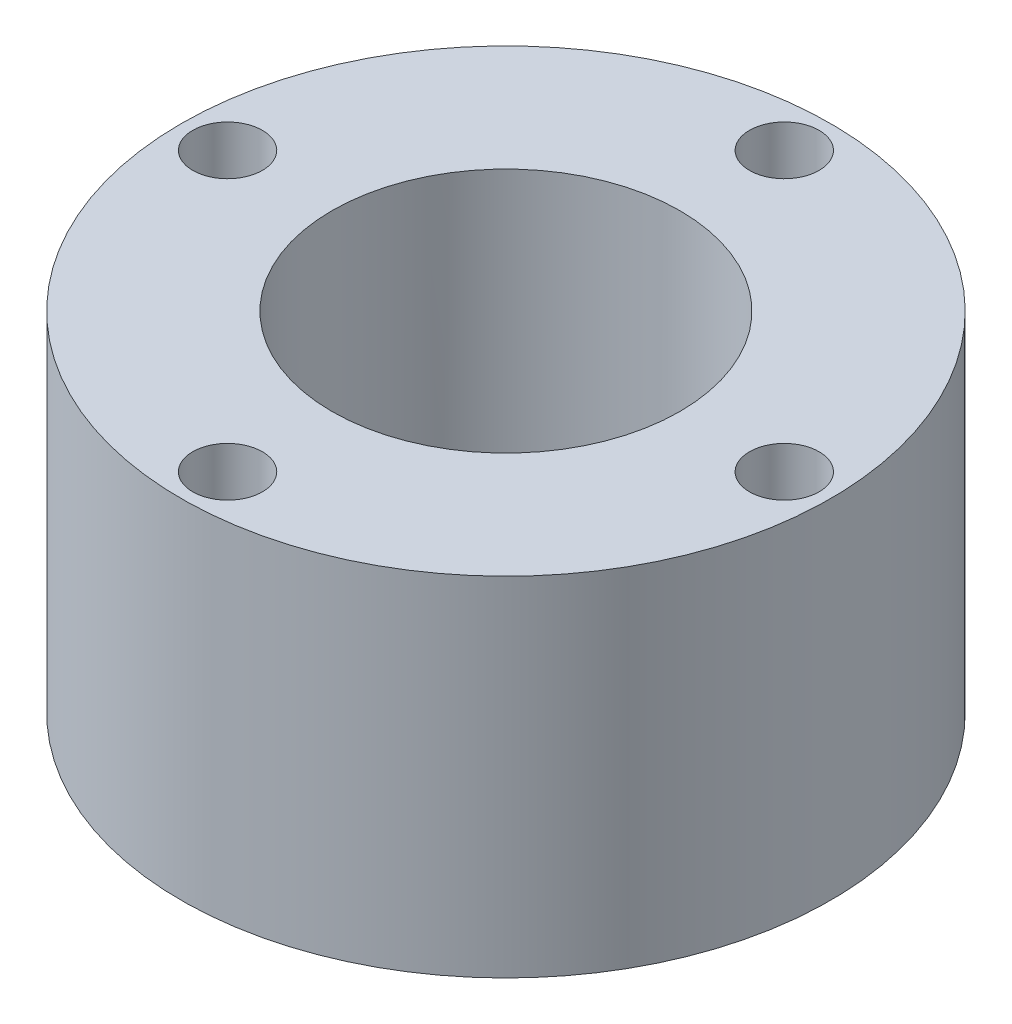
ISO-10303-21;
HEADER;
FILE_DESCRIPTION(('STEP AP214'),'2;1');
FILE_NAME('part.step','',(''),(''),'','','');
FILE_SCHEMA(('AUTOMOTIVE_DESIGN { 1 0 10303 214 1 1 1 1 }'));
ENDSEC;
DATA;
#1=APPLICATION_CONTEXT('core data for automotive mechanical design processes');
#2=APPLICATION_PROTOCOL_DEFINITION('international standard','automotive_design',2000,#1);
#3=PRODUCT_CONTEXT('',#1,'mechanical');
#4=PRODUCT('Part','Part','',(#3));
#5=PRODUCT_RELATED_PRODUCT_CATEGORY('part','',(#4));
#6=PRODUCT_DEFINITION_FORMATION('','',#4);
#7=PRODUCT_DEFINITION_CONTEXT('part definition',#1,'design');
#8=PRODUCT_DEFINITION('design','',#6,#7);
#9=PRODUCT_DEFINITION_SHAPE('','',#8);
#10=(LENGTH_UNIT() NAMED_UNIT(*) SI_UNIT(.MILLI.,.METRE.));
#11=(NAMED_UNIT(*) PLANE_ANGLE_UNIT() SI_UNIT($,.RADIAN.));
#12=(NAMED_UNIT(*) SI_UNIT($,.STERADIAN.) SOLID_ANGLE_UNIT());
#13=UNCERTAINTY_MEASURE_WITH_UNIT(LENGTH_MEASURE(1.E-05),#10,'distance_accuracy_value','');
#14=(GEOMETRIC_REPRESENTATION_CONTEXT(3) GLOBAL_UNCERTAINTY_ASSIGNED_CONTEXT((#13)) GLOBAL_UNIT_ASSIGNED_CONTEXT((#10,
#11,#12)) REPRESENTATION_CONTEXT('',''));
#15=CARTESIAN_POINT('',(0.,0.,0.));
#16=DIRECTION('',(0.,0.,1.));
#17=DIRECTION('',(1.,0.,0.));
#18=AXIS2_PLACEMENT_3D('',#15,#16,#17);
#19=CARTESIAN_POINT('',(0.,120.,0.));
#20=DIRECTION('',(0.,1.,0.));
#21=DIRECTION('',(-1.,0.,0.));
#22=AXIS2_PLACEMENT_3D('',#19,#20,#21);
#23=CYLINDRICAL_SURFACE('',#22,14.);
#24=CARTESIAN_POINT('',(0.,0.,0.));
#25=DIRECTION('',(0.,1.,0.));
#26=DIRECTION('',(-1.,0.,0.));
#27=AXIS2_PLACEMENT_3D('',#24,#25,#26);
#28=CIRCLE('',#27,14.);
#29=CARTESIAN_POINT('',(-14.,0.,0.));
#30=VERTEX_POINT('',#29);
#31=EDGE_CURVE('E10',#30,#30,#28,.T.);
#32=ORIENTED_EDGE('',*,*,#31,.T.);
#33=EDGE_LOOP('',(#32));
#34=FACE_BOUND('',#33,.T.);
#35=CARTESIAN_POINT('',(0.,15.,0.));
#36=DIRECTION('',(0.,1.,0.));
#37=DIRECTION('',(-1.,0.,0.));
#38=AXIS2_PLACEMENT_3D('',#35,#36,#37);
#39=CIRCLE('',#38,14.);
#40=CARTESIAN_POINT('',(-14.,15.,0.));
#41=VERTEX_POINT('',#40);
#42=EDGE_CURVE('E46',#41,#41,#39,.T.);
#43=ORIENTED_EDGE('',*,*,#42,.F.);
#44=EDGE_LOOP('',(#43));
#45=FACE_BOUND('',#44,.T.);
#46=ADVANCED_FACE('F32',(#34,#45),#23,.T.);
#47=CARTESIAN_POINT('',(0.,15.8,0.));
#48=DIRECTION('',(0.,-1.,0.));
#49=DIRECTION('',(1.,0.,0.));
#50=AXIS2_PLACEMENT_3D('',#47,#48,#49);
#51=CYLINDRICAL_SURFACE('',#50,7.5);
#52=CARTESIAN_POINT('',(0.,0.,0.));
#53=DIRECTION('',(0.,-1.,0.));
#54=DIRECTION('',(1.,0.,0.));
#55=AXIS2_PLACEMENT_3D('',#52,#53,#54);
#56=CIRCLE('',#55,7.5);
#57=CARTESIAN_POINT('',(7.5,0.,0.));
#58=VERTEX_POINT('',#57);
#59=EDGE_CURVE('E40',#58,#58,#56,.T.);
#60=ORIENTED_EDGE('',*,*,#59,.T.);
#61=EDGE_LOOP('',(#60));
#62=FACE_BOUND('',#61,.T.);
#63=CARTESIAN_POINT('',(0.,15.,0.));
#64=DIRECTION('',(0.,1.,0.));
#65=DIRECTION('',(-1.,0.,0.));
#66=AXIS2_PLACEMENT_3D('',#63,#64,#65);
#67=CIRCLE('',#66,7.5);
#68=CARTESIAN_POINT('',(-7.5,15.,0.));
#69=VERTEX_POINT('',#68);
#70=EDGE_CURVE('E36',#69,#69,#67,.F.);
#71=ORIENTED_EDGE('',*,*,#70,.F.);
#72=EDGE_LOOP('',(#71));
#73=FACE_BOUND('',#72,.T.);
#74=ADVANCED_FACE('F99',(#62,#73),#51,.F.);
#75=CARTESIAN_POINT('',(0.,0.,0.));
#76=DIRECTION('',(0.,1.,0.));
#77=DIRECTION('',(-1.,0.,0.));
#78=AXIS2_PLACEMENT_3D('',#75,#76,#77);
#79=PLANE('',#78);
#80=ORIENTED_EDGE('',*,*,#59,.F.);
#81=EDGE_LOOP('',(#80));
#82=FACE_BOUND('',#81,.T.);
#83=ORIENTED_EDGE('',*,*,#31,.F.);
#84=EDGE_LOOP('',(#83));
#85=FACE_BOUND('',#84,.T.);
#86=ADVANCED_FACE('F34',(#82,#85),#79,.F.);
#87=CARTESIAN_POINT('',(0.,15.,0.));
#88=DIRECTION('',(0.,1.,0.));
#89=DIRECTION('',(-1.,0.,0.));
#90=AXIS2_PLACEMENT_3D('',#87,#88,#89);
#91=PLANE('',#90);
#92=CARTESIAN_POINT('',(-11.9999999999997,15.,3.41060513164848E-13));
#93=DIRECTION('',(0.,1.,0.));
#94=DIRECTION('',(-1.,0.,0.));
#95=AXIS2_PLACEMENT_3D('',#92,#93,#94);
#96=CIRCLE('',#95,1.50000000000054);
#97=CARTESIAN_POINT('',(-13.5000000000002,15.,3.41060513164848E-13));
#98=VERTEX_POINT('',#97);
#99=EDGE_CURVE('E68',#98,#98,#96,.T.);
#100=ORIENTED_EDGE('',*,*,#99,.F.);
#101=EDGE_LOOP('',(#100));
#102=FACE_BOUND('',#101,.T.);
#103=CARTESIAN_POINT('',(6.78965033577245E-13,15.,12.));
#104=DIRECTION('',(0.,1.,0.));
#105=DIRECTION('',(-1.,0.,0.));
#106=AXIS2_PLACEMENT_3D('',#103,#104,#105);
#107=CIRCLE('',#106,1.50000000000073);
#108=CARTESIAN_POINT('',(-1.50000000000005,15.,12.));
#109=VERTEX_POINT('',#108);
#110=EDGE_CURVE('E62',#109,#109,#107,.T.);
#111=ORIENTED_EDGE('',*,*,#110,.F.);
#112=EDGE_LOOP('',(#111));
#113=FACE_BOUND('',#112,.T.);
#114=CARTESIAN_POINT('',(12.0000000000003,15.,-3.39590937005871E-13));
#115=DIRECTION('',(0.,1.,0.));
#116=DIRECTION('',(-1.,0.,0.));
#117=AXIS2_PLACEMENT_3D('',#114,#115,#116);
#118=CIRCLE('',#117,1.50000000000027);
#119=CARTESIAN_POINT('',(10.5000000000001,15.,-3.39590937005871E-13));
#120=VERTEX_POINT('',#119);
#121=EDGE_CURVE('E56',#120,#120,#118,.T.);
#122=ORIENTED_EDGE('',*,*,#121,.F.);
#123=EDGE_LOOP('',(#122));
#124=FACE_BOUND('',#123,.T.);
#125=CARTESIAN_POINT('',(0.,15.,-12.));
#126=DIRECTION('',(0.,1.,0.));
#127=DIRECTION('',(-1.,0.,0.));
#128=AXIS2_PLACEMENT_3D('',#125,#126,#127);
#129=CIRCLE('',#128,1.5);
#130=CARTESIAN_POINT('',(-1.5,15.,-12.));
#131=VERTEX_POINT('',#130);
#132=EDGE_CURVE('E50',#131,#131,#129,.T.);
#133=ORIENTED_EDGE('',*,*,#132,.F.);
#134=EDGE_LOOP('',(#133));
#135=FACE_BOUND('',#134,.T.);
#136=ORIENTED_EDGE('',*,*,#42,.T.);
#137=EDGE_LOOP('',(#136));
#138=FACE_BOUND('',#137,.T.);
#139=ORIENTED_EDGE('',*,*,#70,.T.);
#140=EDGE_LOOP('',(#139));
#141=FACE_BOUND('',#140,.T.);
#142=ADVANCED_FACE('F83',(#102,#113,#124,#135,#138,#141),#91,.T.);
#143=CARTESIAN_POINT('',(0.,11.5,-12.));
#144=DIRECTION('',(0.,1.,0.));
#145=DIRECTION('',(-1.,0.,0.));
#146=AXIS2_PLACEMENT_3D('',#143,#144,#145);
#147=CYLINDRICAL_SURFACE('',#146,1.5);
#148=CARTESIAN_POINT('',(0.,11.5,-12.));
#149=DIRECTION('',(0.,1.,0.));
#150=DIRECTION('',(-1.,0.,0.));
#151=AXIS2_PLACEMENT_3D('',#148,#149,#150);
#152=CIRCLE('',#151,1.5);
#153=CARTESIAN_POINT('',(-1.5,11.5,-12.));
#154=VERTEX_POINT('',#153);
#155=EDGE_CURVE('E49',#154,#154,#152,.T.);
#156=ORIENTED_EDGE('',*,*,#155,.F.);
#157=EDGE_LOOP('',(#156));
#158=FACE_BOUND('',#157,.T.);
#159=ORIENTED_EDGE('',*,*,#132,.T.);
#160=EDGE_LOOP('',(#159));
#161=FACE_BOUND('',#160,.T.);
#162=ADVANCED_FACE('F86',(#158,#161),#147,.F.);
#163=CARTESIAN_POINT('',(0.,11.5,-12.));
#164=DIRECTION('',(0.,1.,0.));
#165=DIRECTION('',(-1.,0.,0.));
#166=AXIS2_PLACEMENT_3D('',#163,#164,#165);
#167=PLANE('',#166);
#168=ORIENTED_EDGE('',*,*,#155,.T.);
#169=EDGE_LOOP('',(#168));
#170=FACE_BOUND('',#169,.T.);
#171=ADVANCED_FACE('F112',(#170),#167,.T.);
#172=CARTESIAN_POINT('',(12.0000000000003,11.5,-3.39590937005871E-13));
#173=DIRECTION('',(0.,1.,0.));
#174=DIRECTION('',(-1.,0.,0.));
#175=AXIS2_PLACEMENT_3D('',#172,#173,#174);
#176=CYLINDRICAL_SURFACE('',#175,1.50000000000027);
#177=CARTESIAN_POINT('',(12.0000000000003,11.5,-3.39590937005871E-13));
#178=DIRECTION('',(0.,1.,0.));
#179=DIRECTION('',(-1.,0.,0.));
#180=AXIS2_PLACEMENT_3D('',#177,#178,#179);
#181=CIRCLE('',#180,1.50000000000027);
#182=CARTESIAN_POINT('',(10.5000000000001,11.5,-3.39590937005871E-13));
#183=VERTEX_POINT('',#182);
#184=EDGE_CURVE('E53',#183,#183,#181,.T.);
#185=ORIENTED_EDGE('',*,*,#184,.F.);
#186=EDGE_LOOP('',(#185));
#187=FACE_BOUND('',#186,.T.);
#188=ORIENTED_EDGE('',*,*,#121,.T.);
#189=EDGE_LOOP('',(#188));
#190=FACE_BOUND('',#189,.T.);
#191=ADVANCED_FACE('F116',(#187,#190),#176,.F.);
#192=CARTESIAN_POINT('',(12.0000000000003,11.5,-3.39590937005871E-13));
#193=DIRECTION('',(0.,1.,0.));
#194=DIRECTION('',(-1.,0.,0.));
#195=AXIS2_PLACEMENT_3D('',#192,#193,#194);
#196=PLANE('',#195);
#197=ORIENTED_EDGE('',*,*,#184,.T.);
#198=EDGE_LOOP('',(#197));
#199=FACE_BOUND('',#198,.T.);
#200=ADVANCED_FACE('F120',(#199),#196,.T.);
#201=CARTESIAN_POINT('',(6.79015629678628E-13,11.5,12.));
#202=DIRECTION('',(0.,1.,0.));
#203=DIRECTION('',(-1.,0.,0.));
#204=AXIS2_PLACEMENT_3D('',#201,#202,#203);
#205=CYLINDRICAL_SURFACE('',#204,1.50000000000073);
#206=CARTESIAN_POINT('',(6.79015629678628E-13,11.5,12.));
#207=DIRECTION('',(0.,1.,0.));
#208=DIRECTION('',(-1.,0.,0.));
#209=AXIS2_PLACEMENT_3D('',#206,#207,#208);
#210=CIRCLE('',#209,1.50000000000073);
#211=CARTESIAN_POINT('',(-1.50000000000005,11.5,12.));
#212=VERTEX_POINT('',#211);
#213=EDGE_CURVE('E59',#212,#212,#210,.T.);
#214=ORIENTED_EDGE('',*,*,#213,.F.);
#215=EDGE_LOOP('',(#214));
#216=FACE_BOUND('',#215,.T.);
#217=ORIENTED_EDGE('',*,*,#110,.T.);
#218=EDGE_LOOP('',(#217));
#219=FACE_BOUND('',#218,.T.);
#220=ADVANCED_FACE('F124',(#216,#219),#205,.F.);
#221=CARTESIAN_POINT('',(6.79015629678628E-13,11.5,12.));
#222=DIRECTION('',(0.,1.,0.));
#223=DIRECTION('',(-1.,0.,0.));
#224=AXIS2_PLACEMENT_3D('',#221,#222,#223);
#225=PLANE('',#224);
#226=ORIENTED_EDGE('',*,*,#213,.T.);
#227=EDGE_LOOP('',(#226));
#228=FACE_BOUND('',#227,.T.);
#229=ADVANCED_FACE('F79',(#228),#225,.T.);
#230=CARTESIAN_POINT('',(-11.9999999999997,11.5,3.41060513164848E-13));
#231=DIRECTION('',(0.,1.,0.));
#232=DIRECTION('',(-1.,0.,0.));
#233=AXIS2_PLACEMENT_3D('',#230,#231,#232);
#234=CYLINDRICAL_SURFACE('',#233,1.50000000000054);
#235=CARTESIAN_POINT('',(-11.9999999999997,11.5,3.41060513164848E-13));
#236=DIRECTION('',(0.,1.,0.));
#237=DIRECTION('',(-1.,0.,0.));
#238=AXIS2_PLACEMENT_3D('',#235,#236,#237);
#239=CIRCLE('',#238,1.50000000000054);
#240=CARTESIAN_POINT('',(-13.5000000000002,11.5,3.41060513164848E-13));
#241=VERTEX_POINT('',#240);
#242=EDGE_CURVE('E65',#241,#241,#239,.T.);
#243=ORIENTED_EDGE('',*,*,#242,.F.);
#244=EDGE_LOOP('',(#243));
#245=FACE_BOUND('',#244,.T.);
#246=ORIENTED_EDGE('',*,*,#99,.T.);
#247=EDGE_LOOP('',(#246));
#248=FACE_BOUND('',#247,.T.);
#249=ADVANCED_FACE('F76',(#245,#248),#234,.F.);
#250=CARTESIAN_POINT('',(-11.9999999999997,11.5,3.41060513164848E-13));
#251=DIRECTION('',(0.,1.,0.));
#252=DIRECTION('',(-1.,0.,0.));
#253=AXIS2_PLACEMENT_3D('',#250,#251,#252);
#254=PLANE('',#253);
#255=ORIENTED_EDGE('',*,*,#242,.T.);
#256=EDGE_LOOP('',(#255));
#257=FACE_BOUND('',#256,.T.);
#258=ADVANCED_FACE('F74',(#257),#254,.T.);
#259=CLOSED_SHELL('',(#46,#74,#86,#142,#162,#171,#191,#200,#220,#229,#249,#258));
#260=MANIFOLD_SOLID_BREP('B2',#259);
#261=ADVANCED_BREP_SHAPE_REPRESENTATION('',(#18,#260),#14);
#262=SHAPE_DEFINITION_REPRESENTATION(#9,#261);
ENDSEC;
END-ISO-10303-21;
